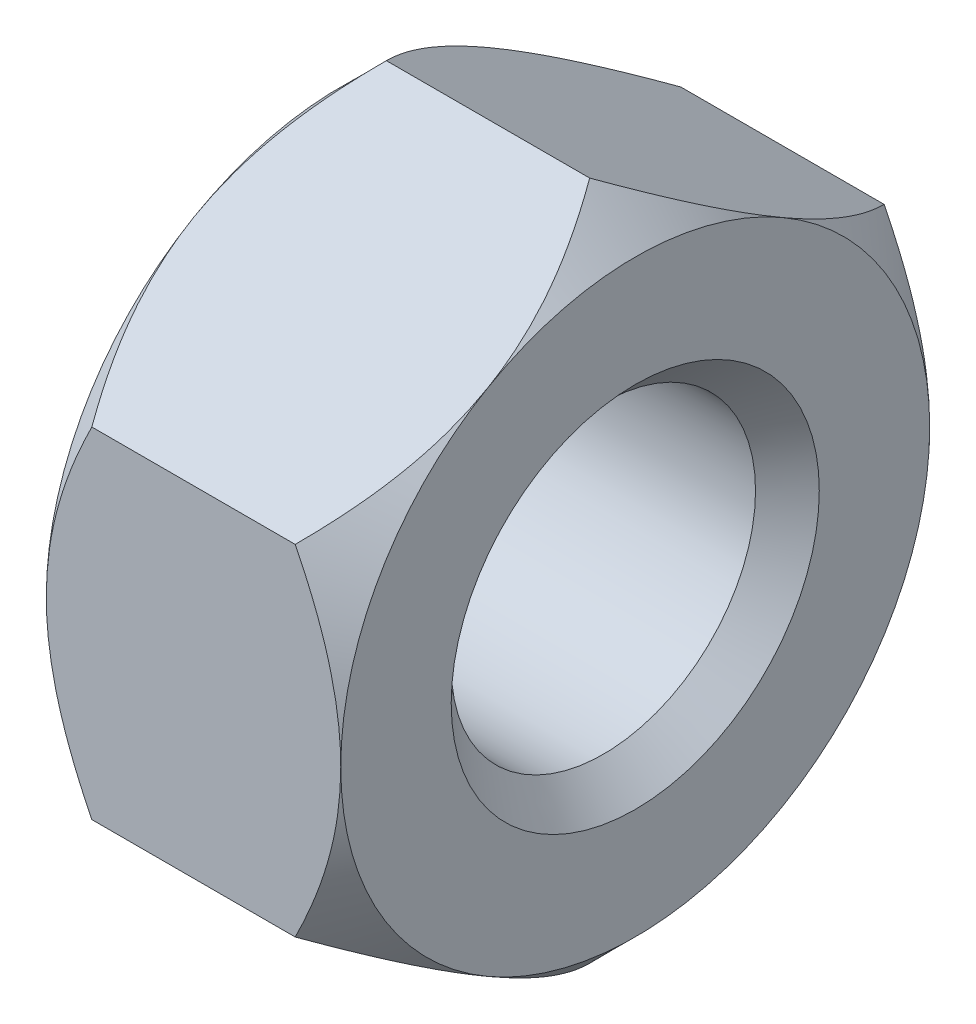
ISO-10303-21;
HEADER;
FILE_DESCRIPTION(('STEP AP214'),'2;1');
FILE_NAME('part.step','',(''),(''),'','','');
FILE_SCHEMA(('AUTOMOTIVE_DESIGN { 1 0 10303 214 1 1 1 1 }'));
ENDSEC;
DATA;
#1=APPLICATION_CONTEXT('core data for automotive mechanical design processes');
#2=APPLICATION_PROTOCOL_DEFINITION('international standard','automotive_design',2000,#1);
#3=PRODUCT_CONTEXT('',#1,'mechanical');
#4=PRODUCT('Part','Part','',(#3));
#5=PRODUCT_RELATED_PRODUCT_CATEGORY('part','',(#4));
#6=PRODUCT_DEFINITION_FORMATION('','',#4);
#7=PRODUCT_DEFINITION_CONTEXT('part definition',#1,'design');
#8=PRODUCT_DEFINITION('design','',#6,#7);
#9=PRODUCT_DEFINITION_SHAPE('','',#8);
#10=(LENGTH_UNIT() NAMED_UNIT(*) SI_UNIT(.MILLI.,.METRE.));
#11=(NAMED_UNIT(*) PLANE_ANGLE_UNIT() SI_UNIT($,.RADIAN.));
#12=(NAMED_UNIT(*) SI_UNIT($,.STERADIAN.) SOLID_ANGLE_UNIT());
#13=UNCERTAINTY_MEASURE_WITH_UNIT(LENGTH_MEASURE(1.E-05),#10,'distance_accuracy_value','');
#14=(GEOMETRIC_REPRESENTATION_CONTEXT(3) GLOBAL_UNCERTAINTY_ASSIGNED_CONTEXT((#13)) GLOBAL_UNIT_ASSIGNED_CONTEXT((#10,
#11,#12)) REPRESENTATION_CONTEXT('',''));
#15=CARTESIAN_POINT('',(0.,0.,0.));
#16=DIRECTION('',(0.,0.,1.));
#17=DIRECTION('',(1.,0.,0.));
#18=AXIS2_PLACEMENT_3D('',#15,#16,#17);
#19=CARTESIAN_POINT('',(4.,4.,0.));
#20=DIRECTION('',(-1.,0.,0.));
#21=DIRECTION('',(0.,0.,1.));
#22=AXIS2_PLACEMENT_3D('',#19,#20,#21);
#23=PLANE('',#22);
#24=CARTESIAN_POINT('',(4.0000000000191,0.,0.));
#25=DIRECTION('',(1.,0.,0.));
#26=DIRECTION('',(0.,0.,-1.));
#27=AXIS2_PLACEMENT_3D('',#24,#25,#26);
#28=CIRCLE('',#27,2.49999999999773);
#29=CARTESIAN_POINT('',(4.0000000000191,0.,-2.49999999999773));
#30=VERTEX_POINT('',#29);
#31=EDGE_CURVE('E273',#30,#30,#28,.F.);
#32=ORIENTED_EDGE('',*,*,#31,.T.);
#33=EDGE_LOOP('',(#32));
#34=FACE_BOUND('',#33,.T.);
#35=CARTESIAN_POINT('',(4.0000000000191,0.,0.));
#36=DIRECTION('',(-1.,0.,0.));
#37=DIRECTION('',(0.,0.,1.));
#38=AXIS2_PLACEMENT_3D('',#35,#36,#37);
#39=CIRCLE('',#38,4.0000000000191);
#40=CARTESIAN_POINT('',(4.00000000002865,-3.46410161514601,2.0000000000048));
#41=VERTEX_POINT('',#40);
#42=CARTESIAN_POINT('',(4.00000000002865,0.,4.00000000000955));
#43=VERTEX_POINT('',#42);
#44=EDGE_CURVE('E117',#41,#43,#39,.T.);
#45=ORIENTED_EDGE('',*,*,#44,.F.);
#46=CARTESIAN_POINT('',(4.0000000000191,0.,0.));
#47=DIRECTION('',(-1.,0.,0.));
#48=DIRECTION('',(0.,0.,1.));
#49=AXIS2_PLACEMENT_3D('',#46,#47,#48);
#50=CIRCLE('',#49,4.0000000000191);
#51=CARTESIAN_POINT('',(4.00000000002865,-3.46410161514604,-2.00000000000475));
#52=VERTEX_POINT('',#51);
#53=EDGE_CURVE('E20',#52,#41,#50,.T.);
#54=ORIENTED_EDGE('',*,*,#53,.F.);
#55=CARTESIAN_POINT('',(4.0000000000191,0.,0.));
#56=DIRECTION('',(-1.,0.,0.));
#57=DIRECTION('',(0.,0.,1.));
#58=AXIS2_PLACEMENT_3D('',#55,#56,#57);
#59=CIRCLE('',#58,4.0000000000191);
#60=CARTESIAN_POINT('',(4.00000000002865,0.,-4.00000000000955));
#61=VERTEX_POINT('',#60);
#62=EDGE_CURVE('E103',#61,#52,#59,.T.);
#63=ORIENTED_EDGE('',*,*,#62,.F.);
#64=CARTESIAN_POINT('',(4.0000000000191,0.,0.));
#65=DIRECTION('',(-1.,0.,0.));
#66=DIRECTION('',(0.,0.,1.));
#67=AXIS2_PLACEMENT_3D('',#64,#65,#66);
#68=CIRCLE('',#67,4.0000000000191);
#69=CARTESIAN_POINT('',(4.00000000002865,3.46410161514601,-2.0000000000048));
#70=VERTEX_POINT('',#69);
#71=EDGE_CURVE('E113',#70,#61,#68,.T.);
#72=ORIENTED_EDGE('',*,*,#71,.F.);
#73=CARTESIAN_POINT('',(4.0000000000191,0.,0.));
#74=DIRECTION('',(-1.,0.,0.));
#75=DIRECTION('',(0.,0.,1.));
#76=AXIS2_PLACEMENT_3D('',#73,#74,#75);
#77=CIRCLE('',#76,4.0000000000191);
#78=CARTESIAN_POINT('',(4.00000000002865,3.46410161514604,2.00000000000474));
#79=VERTEX_POINT('',#78);
#80=EDGE_CURVE('E414',#79,#70,#77,.T.);
#81=ORIENTED_EDGE('',*,*,#80,.F.);
#82=CARTESIAN_POINT('',(4.0000000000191,0.,0.));
#83=DIRECTION('',(-1.,0.,0.));
#84=DIRECTION('',(0.,0.,1.));
#85=AXIS2_PLACEMENT_3D('',#82,#83,#84);
#86=CIRCLE('',#85,4.0000000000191);
#87=EDGE_CURVE('E436',#43,#79,#86,.T.);
#88=ORIENTED_EDGE('',*,*,#87,.F.);
#89=EDGE_LOOP('',(#45,#54,#63,#72,#81,#88));
#90=FACE_BOUND('',#89,.T.);
#91=ADVANCED_FACE('F17',(#34,#90),#23,.F.);
#92=CARTESIAN_POINT('',(3.37748503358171,0.,0.));
#93=DIRECTION('',(-1.,0.,0.));
#94=DIRECTION('',(0.,0.,1.));
#95=AXIS2_PLACEMENT_3D('',#92,#93,#94);
#96=CONICAL_SURFACE('',#95,4.62251496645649,0.785398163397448);
#97=CARTESIAN_POINT('',(4.00000000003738,-3.46410161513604,1.99999999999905));
#98=CARTESIAN_POINT('',(4.0000049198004,-3.49481946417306,1.94679512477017));
#99=CARTESIAN_POINT('',(3.99858391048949,-3.52553272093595,1.89359820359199));
#100=CARTESIAN_POINT('',(3.99293637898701,-3.58688999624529,1.78732428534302));
#101=CARTESIAN_POINT('',(3.98871029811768,-3.61753402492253,1.73424727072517));
#102=CARTESIAN_POINT('',(3.97191541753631,-3.7091658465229,1.57553630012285));
#103=CARTESIAN_POINT('',(3.95522961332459,-3.76997519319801,1.47021142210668));
#104=CARTESIAN_POINT('',(3.9120897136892,-3.88974997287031,1.26275541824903));
#105=CARTESIAN_POINT('',(3.88578673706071,-3.9487293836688,1.16060008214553));
#106=CARTESIAN_POINT('',(3.8245563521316,-4.06556911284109,0.958227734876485));
#107=CARTESIAN_POINT('',(3.78962624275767,-4.12342907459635,0.858011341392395));
#108=CARTESIAN_POINT('',(3.72579547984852,-4.21805562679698,0.694113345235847));
#109=CARTESIAN_POINT('',(3.69899953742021,-4.25518413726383,0.629804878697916));
#110=CARTESIAN_POINT('',(3.64260965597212,-4.32889736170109,0.502129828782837));
#111=CARTESIAN_POINT('',(3.61301630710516,-4.3654821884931,0.438763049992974));
#112=CARTESIAN_POINT('',(3.5510262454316,-4.43849718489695,0.312297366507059));
#113=CARTESIAN_POINT('',(3.51860370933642,-4.47492184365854,0.249208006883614));
#114=CARTESIAN_POINT('',(3.45151314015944,-4.54724829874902,0.123934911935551));
#115=CARTESIAN_POINT('',(3.41684525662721,-4.58315012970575,0.0617511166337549));
#116=CARTESIAN_POINT('',(3.38119784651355,-4.61880215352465,-1.32323642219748E-11));
#117=B_SPLINE_CURVE_WITH_KNOTS('',3,(#97,#98,#99,#100,#101,#102,#103,#104,#105,#106,#107,#108,
#109,#110,#111,#112,#113,#114,#115,#116),.UNSPECIFIED.,.F.,.F.,(4,2,2,2,2,2,2,2,2,4),(0.,
0.184273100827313,0.368517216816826,0.736277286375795,1.09849087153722,1.46081800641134,
1.69759619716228,1.93432454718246,2.17350072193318,2.41266098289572),.UNSPECIFIED.);
#118=CARTESIAN_POINT('',(3.38119784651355,-4.61880215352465,0.));
#119=VERTEX_POINT('',#118);
#120=EDGE_CURVE('E131',#41,#119,#117,.T.);
#121=ORIENTED_EDGE('',*,*,#120,.T.);
#122=CARTESIAN_POINT('',(3.38119784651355,-4.61880215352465,1.32315827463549E-11));
#123=CARTESIAN_POINT('',(3.42115298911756,-4.57884085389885,-0.0692150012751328));
#124=CARTESIAN_POINT('',(3.45987412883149,-4.53857054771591,-0.138965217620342));
#125=CARTESIAN_POINT('',(3.53447131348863,-4.4573496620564,-0.279643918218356));
#126=CARTESIAN_POINT('',(3.57034570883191,-4.41639870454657,-0.350573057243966));
#127=CARTESIAN_POINT('',(3.67347057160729,-4.29201201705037,-0.566017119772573));
#128=CARTESIAN_POINT('',(3.73573980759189,-4.2075147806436,-0.712370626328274));
#129=CARTESIAN_POINT('',(3.84145050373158,-4.03823843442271,-1.00556585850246));
#130=CARTESIAN_POINT('',(3.88538656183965,-3.95353888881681,-1.15226977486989));
#131=CARTESIAN_POINT('',(3.93621631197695,-3.82513617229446,-1.37466980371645));
#132=CARTESIAN_POINT('',(3.95063867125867,-3.78216330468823,-1.44910099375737));
#133=CARTESIAN_POINT('',(3.97413995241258,-3.69585814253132,-1.59858591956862));
#134=CARTESIAN_POINT('',(3.98322052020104,-3.65252596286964,-1.67363945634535));
#135=CARTESIAN_POINT('',(3.99298432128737,-3.58502030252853,-1.79056268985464));
#136=CARTESIAN_POINT('',(3.995606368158,-3.56091327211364,-1.83231729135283));
#137=CARTESIAN_POINT('',(3.99911864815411,-3.51257212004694,-1.91604662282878));
#138=CARTESIAN_POINT('',(4.00000198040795,-3.48833787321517,-1.95802156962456));
#139=CARTESIAN_POINT('',(4.0000000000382,-3.4641016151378,-1.99999999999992));
#140=B_SPLINE_CURVE_WITH_KNOTS('',3,(#122,#123,#124,#125,#126,#127,#128,#129,#130,#131,#132,
#133,#134,#135,#136,#137,#138,#139),.UNSPECIFIED.,.F.,.F.,(4,2,2,2,2,2,2,2,4),(0.,
0.268044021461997,0.536242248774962,1.07581329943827,1.59970270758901,1.86100635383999,
2.1222294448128,2.26705747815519,2.41245917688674),.UNSPECIFIED.);
#141=EDGE_CURVE('E125',#119,#52,#140,.T.);
#142=ORIENTED_EDGE('',*,*,#141,.T.);
#143=ORIENTED_EDGE('',*,*,#53,.T.);
#144=EDGE_LOOP('',(#121,#142,#143));
#145=FACE_BOUND('',#144,.T.);
#146=ADVANCED_FACE('F130',(#145),#96,.T.);
#147=CARTESIAN_POINT('',(3.37748503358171,0.,0.));
#148=DIRECTION('',(-1.,0.,0.));
#149=DIRECTION('',(0.,0.,1.));
#150=AXIS2_PLACEMENT_3D('',#147,#148,#149);
#151=CONICAL_SURFACE('',#150,4.62251496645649,0.785398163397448);
#152=CARTESIAN_POINT('',(4.00000000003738,-3.46410161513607,-1.99999999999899));
#153=CARTESIAN_POINT('',(4.0000049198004,-3.43338376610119,-2.05320487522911));
#154=CARTESIAN_POINT('',(3.99858391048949,-3.40267050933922,-2.10640179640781));
#155=CARTESIAN_POINT('',(3.99293637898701,-3.34131323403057,-2.21267571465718));
#156=CARTESIAN_POINT('',(3.98871029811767,-3.3106692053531,-2.26575272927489));
#157=CARTESIAN_POINT('',(3.97191541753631,-3.21903738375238,-2.42446369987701));
#158=CARTESIAN_POINT('',(3.95522961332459,-3.15822803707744,-2.52978857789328));
#159=CARTESIAN_POINT('',(3.9120897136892,-3.03845325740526,-2.737244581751));
#160=CARTESIAN_POINT('',(3.88578673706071,-2.97947384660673,-2.83939991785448));
#161=CARTESIAN_POINT('',(3.8245563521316,-2.8626341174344,-3.0417722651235));
#162=CARTESIAN_POINT('',(3.78962624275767,-2.80477415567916,-3.1419886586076));
#163=CARTESIAN_POINT('',(3.72579547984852,-2.71014760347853,-3.30588665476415));
#164=CARTESIAN_POINT('',(3.69899953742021,-2.67301909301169,-3.37019512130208));
#165=CARTESIAN_POINT('',(3.64260965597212,-2.59930586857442,-3.49787017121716));
#166=CARTESIAN_POINT('',(3.61301630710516,-2.56272104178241,-3.56123695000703));
#167=CARTESIAN_POINT('',(3.5510262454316,-2.48970604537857,-3.68770263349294));
#168=CARTESIAN_POINT('',(3.51860370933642,-2.45328138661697,-3.75079199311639));
#169=CARTESIAN_POINT('',(3.45151314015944,-2.38095493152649,-3.87606508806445));
#170=CARTESIAN_POINT('',(3.41684525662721,-2.34505310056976,-3.93824888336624));
#171=CARTESIAN_POINT('',(3.38119784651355,-2.30940107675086,-4.00000000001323));
#172=B_SPLINE_CURVE_WITH_KNOTS('',3,(#152,#153,#154,#155,#156,#157,#158,#159,#160,#161,#162,
#163,#164,#165,#166,#167,#168,#169,#170,#171),.UNSPECIFIED.,.F.,.F.,(4,2,2,2,2,2,2,2,2,4),(0.,
0.184273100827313,0.368517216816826,0.736277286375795,1.09849087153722,1.46081800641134,
1.69759619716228,1.93432454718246,2.17350072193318,2.41266098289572),.UNSPECIFIED.);
#173=CARTESIAN_POINT('',(3.38119784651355,-2.30940107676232,-4.00000000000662));
#174=VERTEX_POINT('',#173);
#175=EDGE_CURVE('E107',#52,#174,#172,.T.);
#176=ORIENTED_EDGE('',*,*,#175,.T.);
#177=CARTESIAN_POINT('',(3.38119784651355,-2.30940107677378,-4.));
#178=CARTESIAN_POINT('',(3.42115298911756,-2.22947847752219,-4.));
#179=CARTESIAN_POINT('',(3.45987412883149,-2.14893786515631,-4.));
#180=CARTESIAN_POINT('',(3.53447131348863,-1.98649609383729,-4.));
#181=CARTESIAN_POINT('',(3.57034570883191,-1.90459417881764,-4.));
#182=CARTESIAN_POINT('',(3.67347057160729,-1.65582080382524,-4.));
#183=CARTESIAN_POINT('',(3.73573980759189,-1.48682633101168,-4.));
#184=CARTESIAN_POINT('',(3.84145050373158,-1.14827363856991,-4.));
#185=CARTESIAN_POINT('',(3.88538656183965,-0.978874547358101,-4.));
#186=CARTESIAN_POINT('',(3.93621631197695,-0.722069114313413,-4.));
#187=CARTESIAN_POINT('',(3.95063867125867,-0.636123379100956,-4.));
#188=CARTESIAN_POINT('',(3.97413995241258,-0.46351305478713,-4.));
#189=CARTESIAN_POINT('',(3.98322052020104,-0.376848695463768,-4.));
#190=CARTESIAN_POINT('',(3.99298432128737,-0.241837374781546,-4.));
#191=CARTESIAN_POINT('',(3.995606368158,-0.193623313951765,-4.));
#192=CARTESIAN_POINT('',(3.99911864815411,-0.096941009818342,-4.));
#193=CARTESIAN_POINT('',(4.00000198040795,-0.0484725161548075,-4.));
#194=CARTESIAN_POINT('',(4.0000000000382,0.,-4.));
#195=B_SPLINE_CURVE_WITH_KNOTS('',3,(#177,#178,#179,#180,#181,#182,#183,#184,#185,#186,#187,
#188,#189,#190,#191,#192,#193,#194),.UNSPECIFIED.,.F.,.F.,(4,2,2,2,2,2,2,2,4),(0.,
0.268044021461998,0.536242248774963,1.07581329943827,1.59970270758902,1.86100635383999,
2.1222294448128,2.26705747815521,2.41245917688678),.UNSPECIFIED.);
#196=EDGE_CURVE('E109',#174,#61,#195,.T.);
#197=ORIENTED_EDGE('',*,*,#196,.T.);
#198=ORIENTED_EDGE('',*,*,#62,.T.);
#199=EDGE_LOOP('',(#176,#197,#198));
#200=FACE_BOUND('',#199,.T.);
#201=ADVANCED_FACE('F105',(#200),#151,.T.);
#202=CARTESIAN_POINT('',(3.37748503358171,0.,0.));
#203=DIRECTION('',(-1.,0.,0.));
#204=DIRECTION('',(0.,0.,1.));
#205=AXIS2_PLACEMENT_3D('',#202,#203,#204);
#206=CONICAL_SURFACE('',#205,4.62251496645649,0.785398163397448);
#207=CARTESIAN_POINT('',(4.00000000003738,0.,-3.99999999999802));
#208=CARTESIAN_POINT('',(4.0000049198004,0.0614356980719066,-3.99999999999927));
#209=CARTESIAN_POINT('',(3.99858391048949,0.122862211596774,-3.9999999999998));
#210=CARTESIAN_POINT('',(3.99293637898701,0.245576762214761,-4.0000000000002));
#211=CARTESIAN_POINT('',(3.98871029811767,0.306864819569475,-4.00000000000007));
#212=CARTESIAN_POINT('',(3.97191541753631,0.490128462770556,-3.99999999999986));
#213=CARTESIAN_POINT('',(3.95522961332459,0.61174715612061,-3.99999999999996));
#214=CARTESIAN_POINT('',(3.9120897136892,0.851296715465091,-4.00000000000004));
#215=CARTESIAN_POINT('',(3.8857867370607,0.969255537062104,-4.00000000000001));
#216=CARTESIAN_POINT('',(3.82455635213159,1.20293499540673,-3.99999999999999));
#217=CARTESIAN_POINT('',(3.78962624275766,1.31865491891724,-4.));
#218=CARTESIAN_POINT('',(3.72579547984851,1.50790802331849,-4.));
#219=CARTESIAN_POINT('',(3.6989995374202,1.58216504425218,-4.));
#220=CARTESIAN_POINT('',(3.64260965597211,1.72959149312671,-4.));
#221=CARTESIAN_POINT('',(3.61301630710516,1.80276114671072,-4.));
#222=CARTESIAN_POINT('',(3.55102624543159,1.9487911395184,-4.));
#223=CARTESIAN_POINT('',(3.51860370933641,2.02164045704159,-4.));
#224=CARTESIAN_POINT('',(3.45151314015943,2.16629336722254,-4.));
#225=CARTESIAN_POINT('',(3.41684525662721,2.23809702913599,-4.));
#226=CARTESIAN_POINT('',(3.38119784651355,2.30940107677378,-4.));
#227=B_SPLINE_CURVE_WITH_KNOTS('',3,(#207,#208,#209,#210,#211,#212,#213,#214,#215,#216,#217,
#218,#219,#220,#221,#222,#223,#224,#225,#226),.UNSPECIFIED.,.F.,.F.,(4,2,2,2,2,2,2,2,2,4),(0.,
0.184273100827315,0.368517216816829,0.7362772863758,1.09849087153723,1.46081800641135,
1.69759619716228,1.93432454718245,2.17350072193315,2.41266098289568),.UNSPECIFIED.);
#228=CARTESIAN_POINT('',(3.38119784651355,2.30940107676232,-4.00000000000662));
#229=VERTEX_POINT('',#228);
#230=EDGE_CURVE('E166',#61,#229,#227,.T.);
#231=ORIENTED_EDGE('',*,*,#230,.T.);
#232=CARTESIAN_POINT('',(3.38119784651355,2.30940107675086,-4.00000000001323));
#233=CARTESIAN_POINT('',(3.42115298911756,2.34936237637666,-3.93078499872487));
#234=CARTESIAN_POINT('',(3.45987412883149,2.3896326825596,-3.86103478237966));
#235=CARTESIAN_POINT('',(3.53447131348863,2.47085356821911,-3.72035608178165));
#236=CARTESIAN_POINT('',(3.57034570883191,2.51180452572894,-3.64942694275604));
#237=CARTESIAN_POINT('',(3.67347057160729,2.63619121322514,-3.43398288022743));
#238=CARTESIAN_POINT('',(3.73573980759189,2.72068844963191,-3.28762937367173));
#239=CARTESIAN_POINT('',(3.84145050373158,2.8899647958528,-2.99443414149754));
#240=CARTESIAN_POINT('',(3.88538656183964,2.9746643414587,-2.84773022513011));
#241=CARTESIAN_POINT('',(3.93621631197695,3.10306705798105,-2.62533019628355));
#242=CARTESIAN_POINT('',(3.95063867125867,3.14603992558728,-2.55089900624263));
#243=CARTESIAN_POINT('',(3.97413995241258,3.23234508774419,-2.40141408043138));
#244=CARTESIAN_POINT('',(3.98322052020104,3.27567726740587,-2.32636054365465));
#245=CARTESIAN_POINT('',(3.99298432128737,3.34318292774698,-2.20943731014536));
#246=CARTESIAN_POINT('',(3.995606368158,3.36728995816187,-2.16768270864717));
#247=CARTESIAN_POINT('',(3.99911864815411,3.41563111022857,-2.08395337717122));
#248=CARTESIAN_POINT('',(4.00000198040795,3.43986535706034,-2.04197843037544));
#249=CARTESIAN_POINT('',(4.0000000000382,3.46410161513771,-2.00000000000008));
#250=B_SPLINE_CURVE_WITH_KNOTS('',3,(#232,#233,#234,#235,#236,#237,#238,#239,#240,#241,#242,
#243,#244,#245,#246,#247,#248,#249),.UNSPECIFIED.,.F.,.F.,(4,2,2,2,2,2,2,2,4),(0.,
0.268044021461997,0.536242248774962,1.07581329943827,1.59970270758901,1.86100635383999,
2.1222294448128,2.26705747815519,2.41245917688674),.UNSPECIFIED.);
#251=EDGE_CURVE('E378',#229,#70,#250,.T.);
#252=ORIENTED_EDGE('',*,*,#251,.T.);
#253=ORIENTED_EDGE('',*,*,#71,.T.);
#254=EDGE_LOOP('',(#231,#252,#253));
#255=FACE_BOUND('',#254,.T.);
#256=ADVANCED_FACE('F158',(#255),#206,.T.);
#257=CARTESIAN_POINT('',(3.37748503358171,0.,0.));
#258=DIRECTION('',(-1.,0.,0.));
#259=DIRECTION('',(0.,0.,1.));
#260=AXIS2_PLACEMENT_3D('',#257,#258,#259);
#261=CONICAL_SURFACE('',#260,4.62251496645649,0.785398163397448);
#262=CARTESIAN_POINT('',(4.00000000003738,0.,3.99999999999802));
#263=CARTESIAN_POINT('',(4.0000049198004,-0.0614356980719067,3.99999999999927));
#264=CARTESIAN_POINT('',(3.99858391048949,-0.122862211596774,3.9999999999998));
#265=CARTESIAN_POINT('',(3.99293637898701,-0.245576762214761,4.0000000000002));
#266=CARTESIAN_POINT('',(3.98871029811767,-0.306864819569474,4.00000000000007));
#267=CARTESIAN_POINT('',(3.97191541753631,-0.490128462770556,3.99999999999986));
#268=CARTESIAN_POINT('',(3.95522961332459,-0.61174715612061,3.99999999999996));
#269=CARTESIAN_POINT('',(3.9120897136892,-0.851296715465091,4.00000000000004));
#270=CARTESIAN_POINT('',(3.8857867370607,-0.969255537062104,4.00000000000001));
#271=CARTESIAN_POINT('',(3.82455635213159,-1.20293499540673,3.99999999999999));
#272=CARTESIAN_POINT('',(3.78962624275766,-1.31865491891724,4.));
#273=CARTESIAN_POINT('',(3.72579547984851,-1.50790802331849,4.));
#274=CARTESIAN_POINT('',(3.6989995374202,-1.58216504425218,4.));
#275=CARTESIAN_POINT('',(3.64260965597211,-1.72959149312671,4.));
#276=CARTESIAN_POINT('',(3.61301630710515,-1.80276114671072,4.));
#277=CARTESIAN_POINT('',(3.55102624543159,-1.9487911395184,4.));
#278=CARTESIAN_POINT('',(3.51860370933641,-2.02164045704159,4.));
#279=CARTESIAN_POINT('',(3.45151314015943,-2.16629336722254,4.));
#280=CARTESIAN_POINT('',(3.41684525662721,-2.23809702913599,4.));
#281=CARTESIAN_POINT('',(3.38119784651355,-2.30940107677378,4.));
#282=B_SPLINE_CURVE_WITH_KNOTS('',3,(#262,#263,#264,#265,#266,#267,#268,#269,#270,#271,#272,
#273,#274,#275,#276,#277,#278,#279,#280,#281),.UNSPECIFIED.,.F.,.F.,(4,2,2,2,2,2,2,2,2,4),(0.,
0.184273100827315,0.368517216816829,0.7362772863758,1.09849087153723,1.46081800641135,
1.69759619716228,1.93432454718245,2.17350072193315,2.41266098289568),.UNSPECIFIED.);
#283=CARTESIAN_POINT('',(3.38119784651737,-2.30940107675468,4.00000000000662));
#284=VERTEX_POINT('',#283);
#285=EDGE_CURVE('E284',#43,#284,#282,.T.);
#286=ORIENTED_EDGE('',*,*,#285,.T.);
#287=CARTESIAN_POINT('',(3.38119784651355,-2.30940107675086,4.00000000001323));
#288=CARTESIAN_POINT('',(3.42115298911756,-2.34936237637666,3.93078499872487));
#289=CARTESIAN_POINT('',(3.45987412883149,-2.3896326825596,3.86103478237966));
#290=CARTESIAN_POINT('',(3.53447131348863,-2.47085356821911,3.72035608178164));
#291=CARTESIAN_POINT('',(3.57034570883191,-2.51180452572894,3.64942694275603));
#292=CARTESIAN_POINT('',(3.67347057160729,-2.63619121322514,3.43398288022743));
#293=CARTESIAN_POINT('',(3.73573980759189,-2.72068844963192,3.28762937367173));
#294=CARTESIAN_POINT('',(3.84145050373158,-2.8899647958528,2.99443414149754));
#295=CARTESIAN_POINT('',(3.88538656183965,-2.97466434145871,2.84773022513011));
#296=CARTESIAN_POINT('',(3.93621631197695,-3.10306705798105,2.62533019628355));
#297=CARTESIAN_POINT('',(3.95063867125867,-3.14603992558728,2.55089900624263));
#298=CARTESIAN_POINT('',(3.97413995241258,-3.23234508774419,2.40141408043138));
#299=CARTESIAN_POINT('',(3.98322052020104,-3.27567726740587,2.32636054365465));
#300=CARTESIAN_POINT('',(3.99298432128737,-3.34318292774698,2.20943731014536));
#301=CARTESIAN_POINT('',(3.995606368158,-3.36728995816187,2.16768270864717));
#302=CARTESIAN_POINT('',(3.99911864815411,-3.41563111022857,2.08395337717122));
#303=CARTESIAN_POINT('',(4.00000198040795,-3.43986535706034,2.04197843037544));
#304=CARTESIAN_POINT('',(4.0000000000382,-3.46410161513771,2.00000000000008));
#305=B_SPLINE_CURVE_WITH_KNOTS('',3,(#287,#288,#289,#290,#291,#292,#293,#294,#295,#296,#297,
#298,#299,#300,#301,#302,#303,#304),.UNSPECIFIED.,.F.,.F.,(4,2,2,2,2,2,2,2,4),(0.,
0.268044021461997,0.536242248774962,1.07581329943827,1.59970270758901,1.86100635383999,
2.1222294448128,2.26705747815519,2.41245917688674),.UNSPECIFIED.);
#306=EDGE_CURVE('E267',#284,#41,#305,.T.);
#307=ORIENTED_EDGE('',*,*,#306,.T.);
#308=ORIENTED_EDGE('',*,*,#44,.T.);
#309=EDGE_LOOP('',(#286,#307,#308));
#310=FACE_BOUND('',#309,.T.);
#311=ADVANCED_FACE('F275',(#310),#261,.T.);
#312=CARTESIAN_POINT('',(3.37748503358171,0.,0.));
#313=DIRECTION('',(-1.,0.,0.));
#314=DIRECTION('',(0.,0.,1.));
#315=AXIS2_PLACEMENT_3D('',#312,#313,#314);
#316=CONICAL_SURFACE('',#315,4.62251496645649,0.785398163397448);
#317=CARTESIAN_POINT('',(3.38119784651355,4.61880215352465,-1.32317138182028E-11));
#318=CARTESIAN_POINT('',(3.42115298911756,4.57884085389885,0.0692150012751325));
#319=CARTESIAN_POINT('',(3.45987412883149,4.53857054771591,0.138965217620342));
#320=CARTESIAN_POINT('',(3.53447131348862,4.4573496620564,0.279643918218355));
#321=CARTESIAN_POINT('',(3.57034570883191,4.41639870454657,0.350573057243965));
#322=CARTESIAN_POINT('',(3.67347057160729,4.29201201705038,0.566017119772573));
#323=CARTESIAN_POINT('',(3.73573980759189,4.2075147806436,0.712370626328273));
#324=CARTESIAN_POINT('',(3.84145050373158,4.03823843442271,1.00556585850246));
#325=CARTESIAN_POINT('',(3.88538656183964,3.95353888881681,1.15226977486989));
#326=CARTESIAN_POINT('',(3.93621631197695,3.82513617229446,1.37466980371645));
#327=CARTESIAN_POINT('',(3.95063867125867,3.78216330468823,1.44910099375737));
#328=CARTESIAN_POINT('',(3.97413995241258,3.69585814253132,1.59858591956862));
#329=CARTESIAN_POINT('',(3.98322052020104,3.65252596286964,1.67363945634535));
#330=CARTESIAN_POINT('',(3.99298432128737,3.58502030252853,1.79056268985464));
#331=CARTESIAN_POINT('',(3.995606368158,3.56091327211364,1.83231729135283));
#332=CARTESIAN_POINT('',(3.99911864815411,3.51257212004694,1.91604662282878));
#333=CARTESIAN_POINT('',(4.00000198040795,3.48833787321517,1.95802156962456));
#334=CARTESIAN_POINT('',(4.0000000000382,3.4641016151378,1.99999999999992));
#335=B_SPLINE_CURVE_WITH_KNOTS('',3,(#317,#318,#319,#320,#321,#322,#323,#324,#325,#326,#327,
#328,#329,#330,#331,#332,#333,#334),.UNSPECIFIED.,.F.,.F.,(4,2,2,2,2,2,2,2,4),(0.,
0.268044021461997,0.536242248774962,1.07581329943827,1.59970270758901,1.86100635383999,
2.1222294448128,2.26705747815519,2.41245917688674),.UNSPECIFIED.);
#336=CARTESIAN_POINT('',(3.38119784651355,4.61880215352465,0.));
#337=VERTEX_POINT('',#336);
#338=EDGE_CURVE('E293',#337,#79,#335,.T.);
#339=ORIENTED_EDGE('',*,*,#338,.T.);
#340=ORIENTED_EDGE('',*,*,#80,.T.);
#341=CARTESIAN_POINT('',(4.00000000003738,3.46410161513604,-1.99999999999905));
#342=CARTESIAN_POINT('',(4.0000049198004,3.49481946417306,-1.94679512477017));
#343=CARTESIAN_POINT('',(3.99858391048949,3.52553272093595,-1.89359820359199));
#344=CARTESIAN_POINT('',(3.99293637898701,3.58688999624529,-1.78732428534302));
#345=CARTESIAN_POINT('',(3.98871029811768,3.61753402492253,-1.73424727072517));
#346=CARTESIAN_POINT('',(3.97191541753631,3.70916584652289,-1.57553630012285));
#347=CARTESIAN_POINT('',(3.95522961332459,3.76997519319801,-1.47021142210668));
#348=CARTESIAN_POINT('',(3.9120897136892,3.88974997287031,-1.26275541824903));
#349=CARTESIAN_POINT('',(3.88578673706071,3.94872938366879,-1.16060008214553));
#350=CARTESIAN_POINT('',(3.8245563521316,4.06556911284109,-0.958227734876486));
#351=CARTESIAN_POINT('',(3.78962624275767,4.12342907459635,-0.858011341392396));
#352=CARTESIAN_POINT('',(3.72579547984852,4.21805562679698,-0.694113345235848));
#353=CARTESIAN_POINT('',(3.69899953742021,4.25518413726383,-0.629804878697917));
#354=CARTESIAN_POINT('',(3.64260965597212,4.32889736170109,-0.502129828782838));
#355=CARTESIAN_POINT('',(3.61301630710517,4.3654821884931,-0.438763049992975));
#356=CARTESIAN_POINT('',(3.5510262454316,4.43849718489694,-0.312297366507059));
#357=CARTESIAN_POINT('',(3.51860370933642,4.47492184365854,-0.249208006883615));
#358=CARTESIAN_POINT('',(3.45151314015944,4.54724829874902,-0.123934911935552));
#359=CARTESIAN_POINT('',(3.41684525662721,4.58315012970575,-0.0617511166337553));
#360=CARTESIAN_POINT('',(3.38119784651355,4.61880215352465,1.32321734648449E-11));
#361=B_SPLINE_CURVE_WITH_KNOTS('',3,(#341,#342,#343,#344,#345,#346,#347,#348,#349,#350,#351,
#352,#353,#354,#355,#356,#357,#358,#359,#360),.UNSPECIFIED.,.F.,.F.,(4,2,2,2,2,2,2,2,2,4),(0.,
0.184273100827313,0.368517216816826,0.736277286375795,1.09849087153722,1.46081800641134,
1.69759619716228,1.93432454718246,2.17350072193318,2.41266098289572),.UNSPECIFIED.);
#362=EDGE_CURVE('E416',#70,#337,#361,.T.);
#363=ORIENTED_EDGE('',*,*,#362,.T.);
#364=EDGE_LOOP('',(#339,#340,#363));
#365=FACE_BOUND('',#364,.T.);
#366=ADVANCED_FACE('F279',(#365),#316,.T.);
#367=CARTESIAN_POINT('',(3.37748503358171,0.,0.));
#368=DIRECTION('',(-1.,0.,0.));
#369=DIRECTION('',(0.,0.,1.));
#370=AXIS2_PLACEMENT_3D('',#367,#368,#369);
#371=CONICAL_SURFACE('',#370,4.62251496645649,0.785398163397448);
#372=CARTESIAN_POINT('',(4.00000000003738,3.46410161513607,1.99999999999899));
#373=CARTESIAN_POINT('',(4.0000049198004,3.43338376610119,2.05320487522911));
#374=CARTESIAN_POINT('',(3.99858391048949,3.40267050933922,2.10640179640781));
#375=CARTESIAN_POINT('',(3.99293637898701,3.34131323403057,2.21267571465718));
#376=CARTESIAN_POINT('',(3.98871029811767,3.3106692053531,2.26575272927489));
#377=CARTESIAN_POINT('',(3.97191541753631,3.21903738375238,2.42446369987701));
#378=CARTESIAN_POINT('',(3.95522961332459,3.15822803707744,2.52978857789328));
#379=CARTESIAN_POINT('',(3.9120897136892,3.03845325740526,2.737244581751));
#380=CARTESIAN_POINT('',(3.88578673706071,2.97947384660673,2.83939991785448));
#381=CARTESIAN_POINT('',(3.8245563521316,2.8626341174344,3.0417722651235));
#382=CARTESIAN_POINT('',(3.78962624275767,2.80477415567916,3.1419886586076));
#383=CARTESIAN_POINT('',(3.72579547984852,2.71014760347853,3.30588665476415));
#384=CARTESIAN_POINT('',(3.69899953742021,2.67301909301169,3.37019512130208));
#385=CARTESIAN_POINT('',(3.64260965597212,2.59930586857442,3.49787017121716));
#386=CARTESIAN_POINT('',(3.61301630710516,2.56272104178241,3.56123695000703));
#387=CARTESIAN_POINT('',(3.5510262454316,2.48970604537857,3.68770263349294));
#388=CARTESIAN_POINT('',(3.51860370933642,2.45328138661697,3.75079199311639));
#389=CARTESIAN_POINT('',(3.45151314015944,2.38095493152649,3.87606508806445));
#390=CARTESIAN_POINT('',(3.41684525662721,2.34505310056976,3.93824888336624));
#391=CARTESIAN_POINT('',(3.38119784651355,2.30940107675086,4.00000000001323));
#392=B_SPLINE_CURVE_WITH_KNOTS('',3,(#372,#373,#374,#375,#376,#377,#378,#379,#380,#381,#382,
#383,#384,#385,#386,#387,#388,#389,#390,#391),.UNSPECIFIED.,.F.,.F.,(4,2,2,2,2,2,2,2,2,4),(0.,
0.184273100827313,0.368517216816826,0.736277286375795,1.09849087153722,1.46081800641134,
1.69759619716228,1.93432454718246,2.17350072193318,2.41266098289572),.UNSPECIFIED.);
#393=CARTESIAN_POINT('',(3.38119784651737,2.30940107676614,4.));
#394=VERTEX_POINT('',#393);
#395=EDGE_CURVE('E386',#79,#394,#392,.T.);
#396=ORIENTED_EDGE('',*,*,#395,.T.);
#397=CARTESIAN_POINT('',(3.38119784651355,2.30940107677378,4.));
#398=CARTESIAN_POINT('',(3.42115298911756,2.22947847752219,4.));
#399=CARTESIAN_POINT('',(3.45987412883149,2.14893786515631,4.));
#400=CARTESIAN_POINT('',(3.53447131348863,1.98649609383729,4.));
#401=CARTESIAN_POINT('',(3.57034570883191,1.90459417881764,4.));
#402=CARTESIAN_POINT('',(3.67347057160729,1.65582080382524,4.));
#403=CARTESIAN_POINT('',(3.73573980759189,1.48682633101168,4.));
#404=CARTESIAN_POINT('',(3.84145050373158,1.14827363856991,4.));
#405=CARTESIAN_POINT('',(3.88538656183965,0.978874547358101,4.));
#406=CARTESIAN_POINT('',(3.93621631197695,0.722069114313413,4.));
#407=CARTESIAN_POINT('',(3.95063867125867,0.636123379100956,4.));
#408=CARTESIAN_POINT('',(3.97413995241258,0.463513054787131,4.));
#409=CARTESIAN_POINT('',(3.98322052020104,0.376848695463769,4.));
#410=CARTESIAN_POINT('',(3.99298432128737,0.241837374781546,4.));
#411=CARTESIAN_POINT('',(3.995606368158,0.193623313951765,4.));
#412=CARTESIAN_POINT('',(3.99911864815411,0.0969410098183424,4.));
#413=CARTESIAN_POINT('',(4.00000198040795,0.0484725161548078,4.));
#414=CARTESIAN_POINT('',(4.0000000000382,0.,4.));
#415=B_SPLINE_CURVE_WITH_KNOTS('',3,(#397,#398,#399,#400,#401,#402,#403,#404,#405,#406,#407,
#408,#409,#410,#411,#412,#413,#414),.UNSPECIFIED.,.F.,.F.,(4,2,2,2,2,2,2,2,4),(0.,
0.268044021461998,0.536242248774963,1.07581329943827,1.59970270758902,1.86100635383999,
2.1222294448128,2.26705747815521,2.41245917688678),.UNSPECIFIED.);
#416=EDGE_CURVE('E292',#394,#43,#415,.T.);
#417=ORIENTED_EDGE('',*,*,#416,.T.);
#418=ORIENTED_EDGE('',*,*,#87,.T.);
#419=EDGE_LOOP('',(#396,#417,#418));
#420=FACE_BOUND('',#419,.T.);
#421=ADVANCED_FACE('F400',(#420),#371,.T.);
#422=CARTESIAN_POINT('',(4.0000000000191,0.,0.));
#423=DIRECTION('',(1.,0.,0.));
#424=DIRECTION('',(0.,0.,-1.));
#425=AXIS2_PLACEMENT_3D('',#422,#423,#424);
#426=CONICAL_SURFACE('',#425,2.49999999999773,0.785398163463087);
#427=CARTESIAN_POINT('',(3.567,0.,0.));
#428=DIRECTION('',(-1.,0.,0.));
#429=DIRECTION('',(0.,0.,1.));
#430=AXIS2_PLACEMENT_3D('',#427,#428,#429);
#431=CIRCLE('',#430,2.067);
#432=CARTESIAN_POINT('',(3.567,0.,2.067));
#433=VERTEX_POINT('',#432);
#434=EDGE_CURVE('E370',#433,#433,#431,.T.);
#435=ORIENTED_EDGE('',*,*,#434,.T.);
#436=EDGE_LOOP('',(#435));
#437=FACE_BOUND('',#436,.T.);
#438=ORIENTED_EDGE('',*,*,#31,.F.);
#439=EDGE_LOOP('',(#438));
#440=FACE_BOUND('',#439,.T.);
#441=ADVANCED_FACE('F255',(#437,#440),#426,.F.);
#442=CARTESIAN_POINT('',(8.,-2.3094010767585,4.));
#443=DIRECTION('',(0.,0.866025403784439,-0.5));
#444=DIRECTION('',(0.,0.5,0.866025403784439));
#445=AXIS2_PLACEMENT_3D('',#442,#443,#444);
#446=PLANE('',#445);
#447=ORIENTED_EDGE('',*,*,#120,.F.);
#448=ORIENTED_EDGE('',*,*,#306,.F.);
#449=DIRECTION('',(-1.,0.,0.));
#450=VECTOR('',#449,1.);
#451=CARTESIAN_POINT('',(8.,-2.3094010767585,4.));
#452=LINE('',#451,#450);
#453=CARTESIAN_POINT('',(0.618802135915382,-2.30940109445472,3.99999996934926));
#454=VERTEX_POINT('',#453);
#455=EDGE_CURVE('E291',#284,#454,#452,.T.);
#456=ORIENTED_EDGE('',*,*,#455,.T.);
#457=CARTESIAN_POINT('',(9.15704918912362E-11,-3.46410161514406,2.00000000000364));
#458=CARTESIAN_POINT('',(-4.91966902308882E-06,-3.43338376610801,2.05320487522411));
#459=CARTESIAN_POINT('',(0.00141608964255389,-3.40267050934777,2.10640179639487));
#460=CARTESIAN_POINT('',(0.00706362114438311,-3.34131323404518,2.21267571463));
#461=CARTESIAN_POINT('',(0.0112897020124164,-3.31066920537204,2.26575272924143));
#462=CARTESIAN_POINT('',(0.0280845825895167,-3.21903738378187,2.42446369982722));
#463=CARTESIAN_POINT('',(0.044770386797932,-3.15822803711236,2.52978857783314));
#464=CARTESIAN_POINT('',(0.0879102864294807,-3.03845325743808,2.73724458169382));
#465=CARTESIAN_POINT('',(0.114213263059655,-2.97947384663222,2.83939991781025));
#466=CARTESIAN_POINT('',(0.175443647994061,-2.86263411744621,3.04177226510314));
#467=CARTESIAN_POINT('',(0.210373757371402,-2.80477415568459,3.1419886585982));
#468=CARTESIAN_POINT('',(0.274204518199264,-2.7101476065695,3.30588664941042));
#469=CARTESIAN_POINT('',(0.301000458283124,-2.67301909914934,3.37019511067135));
#470=CARTESIAN_POINT('',(0.357390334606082,-2.59930588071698,3.49787015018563));
#471=CARTESIAN_POINT('',(0.38698368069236,-2.5627210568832,3.56123692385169));
#472=CARTESIAN_POINT('',(0.44897373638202,-2.48970606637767,3.68770259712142));
#473=CARTESIAN_POINT('',(0.48139626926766,-2.45328141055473,3.75079195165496));
#474=CARTESIAN_POINT('',(0.548486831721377,-2.38095496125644,3.87606503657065));
#475=CARTESIAN_POINT('',(0.583154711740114,-2.34505313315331,3.93824882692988));
#476=CARTESIAN_POINT('',(0.618802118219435,-2.30940111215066,3.99999993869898));
#477=B_SPLINE_CURVE_WITH_KNOTS('',3,(#457,#458,#459,#460,#461,#462,#463,#464,#465,#466,#467,
#468,#469,#470,#471,#472,#473,#474,#475,#476),.UNSPECIFIED.,.F.,.F.,(4,2,2,2,2,2,2,2,2,4),(0.,
0.184273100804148,0.368517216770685,0.736277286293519,1.09849087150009,1.46081800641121,
1.69759617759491,1.93432450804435,2.17350066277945,2.41266090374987),.UNSPECIFIED.);
#478=CARTESIAN_POINT('',(7.57158608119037E-11,-3.46410161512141,1.99999999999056));
#479=VERTEX_POINT('',#478);
#480=EDGE_CURVE('E261',#479,#454,#477,.T.);
#481=ORIENTED_EDGE('',*,*,#480,.F.);
#482=CARTESIAN_POINT('',(0.618802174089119,-4.61880213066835,-2.1697438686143E-08));
#483=CARTESIAN_POINT('',(0.578847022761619,-4.57884084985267,0.0692149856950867));
#484=CARTESIAN_POINT('',(0.540125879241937,-4.53857055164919,0.13896520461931));
#485=CARTESIAN_POINT('',(0.465528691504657,-4.45734967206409,0.279643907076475));
#486=CARTESIAN_POINT('',(0.429654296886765,-4.41639871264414,0.350573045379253));
#487=CARTESIAN_POINT('',(0.32652943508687,-4.29201202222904,0.566017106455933));
#488=CARTESIAN_POINT('',(0.264260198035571,-4.20751478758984,0.712370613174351));
#489=CARTESIAN_POINT('',(0.158549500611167,-4.03823844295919,1.0055658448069));
#490=CARTESIAN_POINT('',(0.114613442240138,-3.9535388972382,1.1522697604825));
#491=CARTESIAN_POINT('',(0.0637836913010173,-3.825136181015,1.37466978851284));
#492=CARTESIAN_POINT('',(0.04936133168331,-3.78216331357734,1.4491009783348));
#493=CARTESIAN_POINT('',(0.0258600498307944,-3.69585815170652,1.59858590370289));
#494=CARTESIAN_POINT('',(0.0167794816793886,-3.65252597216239,1.67363944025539));
#495=CARTESIAN_POINT('',(0.00701567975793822,-3.58502031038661,1.79056267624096));
#496=CARTESIAN_POINT('',(0.00439363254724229,-3.56091327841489,1.83231728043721));
#497=CARTESIAN_POINT('',(0.000881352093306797,-3.51257212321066,1.9160466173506));
#498=CARTESIAN_POINT('',(-1.98027655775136E-06,-3.48833787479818,1.95802156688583));
#499=CARTESIAN_POINT('',(9.45880727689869E-11,-3.46410161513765,2.00000000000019));
#500=B_SPLINE_CURVE_WITH_KNOTS('',3,(#482,#483,#484,#485,#486,#487,#488,#489,#490,#491,#492,
#493,#494,#495,#496,#497,#498,#499),.UNSPECIFIED.,.F.,.F.,(4,2,2,2,2,2,2,2,4),(0.,
0.268044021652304,0.536242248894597,1.07581329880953,1.59970270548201,1.86100635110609,
2.12222944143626,2.26705748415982,2.41245919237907),.UNSPECIFIED.);
#501=CARTESIAN_POINT('',(0.618802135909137,-4.61880213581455,-3.06615563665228E-08));
#502=VERTEX_POINT('',#501);
#503=EDGE_CURVE('E234',#502,#479,#500,.T.);
#504=ORIENTED_EDGE('',*,*,#503,.F.);
#505=DIRECTION('',(1.,0.,0.));
#506=VECTOR('',#505,1.);
#507=CARTESIAN_POINT('',(8.,-4.61880215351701,0.));
#508=LINE('',#507,#506);
#509=EDGE_CURVE('E132',#502,#119,#508,.T.);
#510=ORIENTED_EDGE('',*,*,#509,.T.);
#511=EDGE_LOOP('',(#447,#448,#456,#481,#504,#510));
#512=FACE_BOUND('',#511,.T.);
#513=ADVANCED_FACE('F251',(#512),#446,.F.);
#514=CARTESIAN_POINT('',(8.,-4.61880215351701,0.));
#515=DIRECTION('',(0.,0.866025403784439,0.5));
#516=DIRECTION('',(0.,-0.5,0.866025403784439));
#517=AXIS2_PLACEMENT_3D('',#514,#515,#516);
#518=PLANE('',#517);
#519=ORIENTED_EDGE('',*,*,#175,.F.);
#520=ORIENTED_EDGE('',*,*,#141,.F.);
#521=ORIENTED_EDGE('',*,*,#509,.F.);
#522=CARTESIAN_POINT('',(9.15715388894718E-11,-3.46410161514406,-2.00000000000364));
#523=CARTESIAN_POINT('',(-4.9196690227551E-06,-3.49481946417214,-1.94679512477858));
#524=CARTESIAN_POINT('',(0.00141608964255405,-3.52553272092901,-1.89359820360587));
#525=CARTESIAN_POINT('',(0.0070636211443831,-3.58688999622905,-1.78732428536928));
#526=CARTESIAN_POINT('',(0.0112897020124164,-3.61753402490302,-1.73424727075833));
#527=CARTESIAN_POINT('',(0.0280845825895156,-3.70916584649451,-1.57553630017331));
#528=CARTESIAN_POINT('',(0.044770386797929,-3.76997519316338,-1.47021142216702));
#529=CARTESIAN_POINT('',(0.0879102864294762,-3.88974997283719,-1.26275541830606));
#530=CARTESIAN_POINT('',(0.114213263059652,-3.94872938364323,-1.16060008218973));
#531=CARTESIAN_POINT('',(0.17544364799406,-4.06556911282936,-0.958227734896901));
#532=CARTESIAN_POINT('',(0.210373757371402,-4.12342907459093,-0.858011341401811));
#533=CARTESIAN_POINT('',(0.274204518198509,-4.21805562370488,-0.694113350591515));
#534=CARTESIAN_POINT('',(0.301000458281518,-4.25518413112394,-0.629804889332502));
#535=CARTESIAN_POINT('',(0.357390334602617,-4.32889734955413,-0.502129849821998));
#536=CARTESIAN_POINT('',(0.386983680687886,-4.36548217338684,-0.438763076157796));
#537=CARTESIAN_POINT('',(0.448973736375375,-4.43849716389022,-0.312297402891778));
#538=CARTESIAN_POINT('',(0.481396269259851,-4.47492181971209,-0.24920804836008));
#539=CARTESIAN_POINT('',(0.548486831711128,-4.54724826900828,-0.123934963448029));
#540=CARTESIAN_POINT('',(0.583154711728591,-4.58315009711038,-0.0617511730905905));
#541=CARTESIAN_POINT('',(0.618802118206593,-4.61880211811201,-6.13232618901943E-08));
#542=B_SPLINE_CURVE_WITH_KNOTS('',3,(#522,#523,#524,#525,#526,#527,#528,#529,#530,#531,#532,
#533,#534,#535,#536,#537,#538,#539,#540,#541),.UNSPECIFIED.,.F.,.F.,(4,2,2,2,2,2,2,2,2,4),(0.,
0.18427310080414,0.368517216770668,0.73627728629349,1.09849087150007,1.46081800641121,
1.69759617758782,1.93432450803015,2.17350066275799,2.41266090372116),.UNSPECIFIED.);
#543=CARTESIAN_POINT('',(7.57160655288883E-11,-3.46410161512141,-1.99999999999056));
#544=VERTEX_POINT('',#543);
#545=EDGE_CURVE('E236',#544,#502,#542,.T.);
#546=ORIENTED_EDGE('',*,*,#545,.F.);
#547=CARTESIAN_POINT('',(0.61880217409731,-2.30940104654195,-3.99999999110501));
#548=CARTESIAN_POINT('',(0.578847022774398,-2.34936236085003,-3.93078500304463));
#549=CARTESIAN_POINT('',(0.540125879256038,-2.38963267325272,-3.86103479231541));
#550=CARTESIAN_POINT('',(0.465528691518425,-2.47085356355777,-3.72035609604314));
#551=CARTESIAN_POINT('',(0.429654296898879,-2.51180451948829,-3.64942695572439));
#552=CARTESIAN_POINT('',(0.326529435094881,-2.63619120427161,-3.43398289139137));
#553=CARTESIAN_POINT('',(0.26426019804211,-2.72068844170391,-3.28762938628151));
#554=CARTESIAN_POINT('',(0.158549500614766,-2.88996478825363,-2.99443415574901));
#555=CARTESIAN_POINT('',(0.114613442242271,-2.97466433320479,-2.84773023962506));
#556=CARTESIAN_POINT('',(0.0637836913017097,-3.10306704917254,-2.62533021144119));
#557=CARTESIAN_POINT('',(0.0493613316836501,-3.14603991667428,-2.55089902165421));
#558=CARTESIAN_POINT('',(0.0258600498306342,-3.23234507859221,-2.40141409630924));
#559=CARTESIAN_POINT('',(0.0167794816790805,-3.27567725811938,-2.32636055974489));
#560=CARTESIAN_POINT('',(0.0070156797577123,-3.34318291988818,-2.20943732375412));
#561=CARTESIAN_POINT('',(0.00439363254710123,-3.36728995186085,-2.1676827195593));
#562=CARTESIAN_POINT('',(0.000881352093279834,-3.41563110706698,-2.08395338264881));
#563=CARTESIAN_POINT('',(-1.98027655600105E-06,-3.43986535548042,-2.04197843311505));
#564=CARTESIAN_POINT('',(9.45880485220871E-11,-3.46410161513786,-1.99999999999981));
#565=B_SPLINE_CURVE_WITH_KNOTS('',3,(#547,#548,#549,#550,#551,#552,#553,#554,#555,#556,#557,
#558,#559,#560,#561,#562,#563,#564),.UNSPECIFIED.,.F.,.F.,(4,2,2,2,2,2,2,2,4),(0.,
0.268044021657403,0.536242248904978,1.0758132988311,1.5997027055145,1.86100635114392,
2.12222944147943,2.26705748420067,2.41245919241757),.UNSPECIFIED.);
#566=CARTESIAN_POINT('',(0.61880213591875,-2.30940104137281,-4.));
#567=VERTEX_POINT('',#566);
#568=EDGE_CURVE('E226',#567,#544,#565,.T.);
#569=ORIENTED_EDGE('',*,*,#568,.F.);
#570=DIRECTION('',(1.,0.,0.));
#571=VECTOR('',#570,1.);
#572=CARTESIAN_POINT('',(8.,-2.3094010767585,-4.));
#573=LINE('',#572,#571);
#574=EDGE_CURVE('E128',#567,#174,#573,.T.);
#575=ORIENTED_EDGE('',*,*,#574,.T.);
#576=EDGE_LOOP('',(#519,#520,#521,#546,#569,#575));
#577=FACE_BOUND('',#576,.T.);
#578=ADVANCED_FACE('F124',(#577),#518,.F.);
#579=CARTESIAN_POINT('',(8.,-2.3094010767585,-4.));
#580=DIRECTION('',(0.,0.,1.));
#581=DIRECTION('',(1.,0.,0.));
#582=AXIS2_PLACEMENT_3D('',#579,#580,#581);
#583=PLANE('',#582);
#584=ORIENTED_EDGE('',*,*,#230,.F.);
#585=ORIENTED_EDGE('',*,*,#196,.F.);
#586=ORIENTED_EDGE('',*,*,#574,.F.);
#587=CARTESIAN_POINT('',(9.15699683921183E-11,0.,-4.00000000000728));
#588=CARTESIAN_POINT('',(-4.91966902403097E-06,-0.0614356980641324,-4.00000000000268));
#589=CARTESIAN_POINT('',(0.00141608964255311,-0.122862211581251,-4.00000000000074));
#590=CARTESIAN_POINT('',(0.00706362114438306,-0.245576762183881,-3.99999999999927));
#591=CARTESIAN_POINT('',(0.0112897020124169,-0.306864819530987,-3.99999999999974));
#592=CARTESIAN_POINT('',(0.0280845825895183,-0.490128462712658,-4.00000000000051));
#593=CARTESIAN_POINT('',(0.0447703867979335,-0.61174715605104,-4.00000000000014));
#594=CARTESIAN_POINT('',(0.087910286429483,-0.851296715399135,-3.99999999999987));
#595=CARTESIAN_POINT('',(0.114213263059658,-0.969255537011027,-3.99999999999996));
#596=CARTESIAN_POINT('',(0.175443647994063,-1.20293499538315,-4.00000000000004));
#597=CARTESIAN_POINT('',(0.210373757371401,-1.31865491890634,-4.00000000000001));
#598=CARTESIAN_POINT('',(0.274204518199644,-1.50790801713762,-3.99999999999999));
#599=CARTESIAN_POINT('',(0.301000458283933,-1.58216503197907,-4.));
#600=CARTESIAN_POINT('',(0.357390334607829,-1.729591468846,-4.));
#601=CARTESIAN_POINT('',(0.386983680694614,-1.80276111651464,-4.));
#602=CARTESIAN_POINT('',(0.448973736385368,-1.94879109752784,-4.));
#603=CARTESIAN_POINT('',(0.481396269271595,-2.0216404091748,-4.));
#604=CARTESIAN_POINT('',(0.548486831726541,-2.16629330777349,-4.));
#605=CARTESIAN_POINT('',(0.583154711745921,-2.2380969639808,-4.));
#606=CARTESIAN_POINT('',(0.618802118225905,-2.30940100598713,-4.));
#607=B_SPLINE_CURVE_WITH_KNOTS('',3,(#587,#588,#589,#590,#591,#592,#593,#594,#595,#596,#597,
#598,#599,#600,#601,#602,#603,#604,#605,#606),.UNSPECIFIED.,.F.,.F.,(4,2,2,2,2,2,2,2,2,4),(0.,
0.184273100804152,0.368517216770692,0.736277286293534,1.09849087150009,1.46081800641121,
1.69759617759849,1.9343245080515,2.17350066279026,2.41266090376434),.UNSPECIFIED.);
#608=CARTESIAN_POINT('',(7.57154252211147E-11,0.,-3.99999999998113));
#609=VERTEX_POINT('',#608);
#610=EDGE_CURVE('E182',#609,#567,#607,.T.);
#611=ORIENTED_EDGE('',*,*,#610,.F.);
#612=CARTESIAN_POINT('',(0.618802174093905,2.30940108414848,-3.99999996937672));
#613=CARTESIAN_POINT('',(0.578847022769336,2.22947848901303,-3.99999998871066));
#614=CARTESIAN_POINT('',(0.540125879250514,2.14893787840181,-3.99999999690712));
#615=CARTESIAN_POINT('',(0.465528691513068,1.98649610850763,-4.00000000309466));
#616=CARTESIAN_POINT('',(0.429654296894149,1.9045941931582,-4.00000000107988));
#617=CARTESIAN_POINT('',(0.326529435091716,1.65582081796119,-3.99999999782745));
#618=CARTESIAN_POINT('',(0.264260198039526,1.48682634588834,-3.9999999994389));
#619=CARTESIAN_POINT('',(0.158549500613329,1.14827365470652,-4.00000000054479));
#620=CARTESIAN_POINT('',(0.114613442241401,0.978874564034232,-4.0000000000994));
#621=CARTESIAN_POINT('',(0.0637836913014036,0.722069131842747,-3.99999999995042));
#622=CARTESIAN_POINT('',(0.0493613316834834,0.636123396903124,-3.99999999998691));
#623=CARTESIAN_POINT('',(0.0258600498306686,0.463513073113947,-4.00000000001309));
#624=CARTESIAN_POINT('',(0.0167794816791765,0.376848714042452,-4.00000000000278));
#625=CARTESIAN_POINT('',(0.00701567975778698,0.241837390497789,-3.99999999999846));
#626=CARTESIAN_POINT('',(0.00439363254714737,0.193623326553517,-3.99999999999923));
#627=CARTESIAN_POINT('',(0.000881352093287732,0.0969410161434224,-4.00000000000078));
#628=CARTESIAN_POINT('',(-1.98027655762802E-06,0.0484725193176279,-4.00000000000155));
#629=CARTESIAN_POINT('',(9.45874315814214E-11,-2.18486559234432E-13,-4.));
#630=B_SPLINE_CURVE_WITH_KNOTS('',3,(#612,#613,#614,#615,#616,#617,#618,#619,#620,#621,#622,
#623,#624,#625,#626,#627,#628,#629),.UNSPECIFIED.,.F.,.F.,(4,2,2,2,2,2,2,2,4),(0.,
0.268044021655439,0.536242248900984,1.07581329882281,1.59970270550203,1.8610063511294,
2.12222944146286,2.26705748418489,2.41245919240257),.UNSPECIFIED.);
#631=CARTESIAN_POINT('',(0.618802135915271,2.30940109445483,-3.99999996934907));
#632=VERTEX_POINT('',#631);
#633=EDGE_CURVE('E191',#632,#609,#630,.T.);
#634=ORIENTED_EDGE('',*,*,#633,.F.);
#635=DIRECTION('',(1.,0.,0.));
#636=VECTOR('',#635,1.);
#637=CARTESIAN_POINT('',(8.,2.3094010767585,-4.));
#638=LINE('',#637,#636);
#639=EDGE_CURVE('E375',#632,#229,#638,.T.);
#640=ORIENTED_EDGE('',*,*,#639,.T.);
#641=EDGE_LOOP('',(#584,#585,#586,#611,#634,#640));
#642=FACE_BOUND('',#641,.T.);
#643=ADVANCED_FACE('F171',(#642),#583,.F.);
#644=CARTESIAN_POINT('',(8.,2.3094010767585,-4.));
#645=DIRECTION('',(0.,-0.866025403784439,0.5));
#646=DIRECTION('',(0.,-0.5,-0.866025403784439));
#647=AXIS2_PLACEMENT_3D('',#644,#645,#646);
#648=PLANE('',#647);
#649=ORIENTED_EDGE('',*,*,#362,.F.);
#650=ORIENTED_EDGE('',*,*,#251,.F.);
#651=ORIENTED_EDGE('',*,*,#639,.F.);
#652=CARTESIAN_POINT('',(9.15704918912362E-11,3.46410161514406,-2.00000000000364));
#653=CARTESIAN_POINT('',(-4.91966902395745E-06,3.43338376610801,-2.05320487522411));
#654=CARTESIAN_POINT('',(0.00141608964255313,3.40267050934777,-2.10640179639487));
#655=CARTESIAN_POINT('',(0.00706362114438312,3.34131323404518,-2.21267571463));
#656=CARTESIAN_POINT('',(0.0112897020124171,3.31066920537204,-2.26575272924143));
#657=CARTESIAN_POINT('',(0.028084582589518,3.21903738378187,-2.42446369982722));
#658=CARTESIAN_POINT('',(0.0447703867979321,3.15822803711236,-2.52978857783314));
#659=CARTESIAN_POINT('',(0.0879102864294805,3.03845325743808,-2.73724458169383));
#660=CARTESIAN_POINT('',(0.114213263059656,2.97947384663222,-2.83939991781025));
#661=CARTESIAN_POINT('',(0.175443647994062,2.86263411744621,-3.04177226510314));
#662=CARTESIAN_POINT('',(0.210373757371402,2.80477415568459,-3.1419886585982));
#663=CARTESIAN_POINT('',(0.274204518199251,2.71014760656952,-3.30588664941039));
#664=CARTESIAN_POINT('',(0.301000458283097,2.67301909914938,-3.37019511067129));
#665=CARTESIAN_POINT('',(0.357390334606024,2.59930588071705,-3.4978701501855));
#666=CARTESIAN_POINT('',(0.386983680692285,2.56272105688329,-3.56123692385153));
#667=CARTESIAN_POINT('',(0.448973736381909,2.4897060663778,-3.68770259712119));
#668=CARTESIAN_POINT('',(0.481396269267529,2.45328141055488,-3.75079195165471));
#669=CARTESIAN_POINT('',(0.548486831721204,2.38095496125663,-3.87606503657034));
#670=CARTESIAN_POINT('',(0.58315471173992,2.34505313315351,-3.93824882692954));
#671=CARTESIAN_POINT('',(0.618802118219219,2.30940111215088,-3.99999993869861));
#672=B_SPLINE_CURVE_WITH_KNOTS('',3,(#652,#653,#654,#655,#656,#657,#658,#659,#660,#661,#662,
#663,#664,#665,#666,#667,#668,#669,#670,#671),.UNSPECIFIED.,.F.,.F.,(4,2,2,2,2,2,2,2,2,4),(0.,
0.184273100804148,0.368517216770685,0.736277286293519,1.09849087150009,1.46081800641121,
1.69759617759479,1.93432450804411,2.17350066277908,2.41266090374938),.UNSPECIFIED.);
#673=CARTESIAN_POINT('',(7.57157745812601E-11,3.46410161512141,-1.99999999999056));
#674=VERTEX_POINT('',#673);
#675=EDGE_CURVE('E199',#674,#632,#672,.T.);
#676=ORIENTED_EDGE('',*,*,#675,.F.);
#677=CARTESIAN_POINT('',(0.618802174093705,4.61880213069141,2.17112537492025E-08));
#678=CARTESIAN_POINT('',(0.578847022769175,4.57884084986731,-0.0692149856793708));
#679=CARTESIAN_POINT('',(0.540125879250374,4.53857055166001,-0.138965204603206));
#680=CARTESIAN_POINT('',(0.465528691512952,4.45734967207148,-0.279643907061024));
#681=CARTESIAN_POINT('',(0.429654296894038,4.41639871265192,-0.350573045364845));
#682=CARTESIAN_POINT('',(0.326529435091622,4.29201202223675,-0.566017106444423));
#683=CARTESIAN_POINT('',(0.264260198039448,4.20751478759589,-0.712370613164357));
#684=CARTESIAN_POINT('',(0.158549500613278,4.03823844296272,-1.00556584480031));
#685=CARTESIAN_POINT('',(0.114613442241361,3.95353889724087,-1.15226976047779));
#686=CARTESIAN_POINT('',(0.0637836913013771,3.82513618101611,-1.37466978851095));
#687=CARTESIAN_POINT('',(0.0493613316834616,3.78216331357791,-1.44910097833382));
#688=CARTESIAN_POINT('',(0.025860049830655,3.695858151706,-1.59858590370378));
#689=CARTESIAN_POINT('',(0.0167794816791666,3.65252597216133,-1.67363944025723));
#690=CARTESIAN_POINT('',(0.00701567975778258,3.58502031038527,-1.79056267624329));
#691=CARTESIAN_POINT('',(0.00439363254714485,3.56091327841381,-1.83231728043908));
#692=CARTESIAN_POINT('',(0.000881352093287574,3.51257212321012,-1.91604661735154));
#693=CARTESIAN_POINT('',(-1.98027655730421E-06,3.48833787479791,-1.9580215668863));
#694=CARTESIAN_POINT('',(9.45875804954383E-11,3.46410161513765,-2.00000000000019));
#695=B_SPLINE_CURVE_WITH_KNOTS('',3,(#677,#678,#679,#680,#681,#682,#683,#684,#685,#686,#687,
#688,#689,#690,#691,#692,#693,#694),.UNSPECIFIED.,.F.,.F.,(4,2,2,2,2,2,2,2,4),(0.,
0.268044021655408,0.536242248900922,1.07581329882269,1.59970270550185,1.8610063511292,
2.12222944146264,2.2670574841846,2.41245919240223),.UNSPECIFIED.);
#696=CARTESIAN_POINT('',(0.618802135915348,4.61880213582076,3.06507988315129E-08));
#697=VERTEX_POINT('',#696);
#698=EDGE_CURVE('E423',#697,#674,#695,.T.);
#699=ORIENTED_EDGE('',*,*,#698,.F.);
#700=DIRECTION('',(1.,0.,0.));
#701=VECTOR('',#700,1.);
#702=CARTESIAN_POINT('',(8.,4.61880215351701,0.));
#703=LINE('',#702,#701);
#704=EDGE_CURVE('E381',#697,#337,#703,.T.);
#705=ORIENTED_EDGE('',*,*,#704,.T.);
#706=EDGE_LOOP('',(#649,#650,#651,#676,#699,#705));
#707=FACE_BOUND('',#706,.T.);
#708=ADVANCED_FACE('F175',(#707),#648,.F.);
#709=CARTESIAN_POINT('',(8.,2.3094010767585,4.));
#710=DIRECTION('',(0.,0.,-1.));
#711=DIRECTION('',(-1.,0.,0.));
#712=AXIS2_PLACEMENT_3D('',#709,#710,#711);
#713=PLANE('',#712);
#714=ORIENTED_EDGE('',*,*,#285,.F.);
#715=ORIENTED_EDGE('',*,*,#416,.F.);
#716=DIRECTION('',(1.,0.,0.));
#717=VECTOR('',#716,1.);
#718=CARTESIAN_POINT('',(8.,2.3094010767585,4.));
#719=LINE('',#718,#717);
#720=CARTESIAN_POINT('',(0.618802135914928,2.30940104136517,4.));
#721=VERTEX_POINT('',#720);
#722=EDGE_CURVE('E372',#394,#721,#719,.F.);
#723=ORIENTED_EDGE('',*,*,#722,.T.);
#724=CARTESIAN_POINT('',(9.15699683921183E-11,0.,4.00000000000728));
#725=CARTESIAN_POINT('',(-4.91966902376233E-06,0.0614356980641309,4.00000000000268));
#726=CARTESIAN_POINT('',(0.00141608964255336,0.122862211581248,4.00000000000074));
#727=CARTESIAN_POINT('',(0.00706362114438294,0.245576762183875,3.99999999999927));
#728=CARTESIAN_POINT('',(0.0112897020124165,0.306864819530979,3.99999999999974));
#729=CARTESIAN_POINT('',(0.0280845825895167,0.490128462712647,4.00000000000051));
#730=CARTESIAN_POINT('',(0.0447703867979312,0.611747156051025,4.00000000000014));
#731=CARTESIAN_POINT('',(0.0879102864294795,0.851296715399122,3.99999999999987));
#732=CARTESIAN_POINT('',(0.114213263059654,0.969255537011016,3.99999999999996));
#733=CARTESIAN_POINT('',(0.17544364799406,1.20293499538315,4.00000000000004));
#734=CARTESIAN_POINT('',(0.210373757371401,1.31865491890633,4.00000000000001));
#735=CARTESIAN_POINT('',(0.274204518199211,1.50790801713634,3.99999999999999));
#736=CARTESIAN_POINT('',(0.301000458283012,1.58216503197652,4.));
#737=CARTESIAN_POINT('',(0.357390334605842,1.72959146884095,4.));
#738=CARTESIAN_POINT('',(0.38698368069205,1.80276111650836,4.));
#739=CARTESIAN_POINT('',(0.44897373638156,1.94879109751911,4.));
#740=CARTESIAN_POINT('',(0.48139626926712,2.02164040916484,4.));
#741=CARTESIAN_POINT('',(0.548486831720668,2.16629330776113,4.));
#742=CARTESIAN_POINT('',(0.583154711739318,2.23809696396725,4.));
#743=CARTESIAN_POINT('',(0.618802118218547,2.30940100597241,4.));
#744=B_SPLINE_CURVE_WITH_KNOTS('',3,(#724,#725,#726,#727,#728,#729,#730,#731,#732,#733,#734,
#735,#736,#737,#738,#739,#740,#741,#742,#743),.UNSPECIFIED.,.F.,.F.,(4,2,2,2,2,2,2,2,2,4),(0.,
0.184273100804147,0.368517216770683,0.736277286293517,1.09849087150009,1.46081800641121,
1.69759617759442,1.93432450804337,2.17350066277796,2.41266090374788),.UNSPECIFIED.);
#745=CARTESIAN_POINT('',(7.57154222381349E-11,0.,3.99999999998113));
#746=VERTEX_POINT('',#745);
#747=EDGE_CURVE('E311',#746,#721,#744,.T.);
#748=ORIENTED_EDGE('',*,*,#747,.F.);
#749=CARTESIAN_POINT('',(0.618802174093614,-2.30940108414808,3.99999996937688));
#750=CARTESIAN_POINT('',(0.578847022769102,-2.22947848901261,3.99999998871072));
#751=CARTESIAN_POINT('',(0.540125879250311,-2.1489378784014,3.99999999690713));
#752=CARTESIAN_POINT('',(0.4655286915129,-1.98649610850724,4.00000000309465));
#753=CARTESIAN_POINT('',(0.429654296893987,-1.90459419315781,4.00000000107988));
#754=CARTESIAN_POINT('',(0.326529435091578,-1.65582081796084,3.99999999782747));
#755=CARTESIAN_POINT('',(0.264260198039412,-1.48682634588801,3.9999999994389));
#756=CARTESIAN_POINT('',(0.158549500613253,-1.14827365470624,4.00000000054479));
#757=CARTESIAN_POINT('',(0.11461344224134,-0.978874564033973,4.0000000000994));
#758=CARTESIAN_POINT('',(0.063783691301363,-0.722069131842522,3.99999999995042));
#759=CARTESIAN_POINT('',(0.0493613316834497,-0.636123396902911,3.99999999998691));
#760=CARTESIAN_POINT('',(0.0258600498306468,-0.463513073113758,4.00000000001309));
#761=CARTESIAN_POINT('',(0.0167794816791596,-0.376848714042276,4.00000000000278));
#762=CARTESIAN_POINT('',(0.00701567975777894,-0.241837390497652,3.99999999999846));
#763=CARTESIAN_POINT('',(0.00439363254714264,-0.193623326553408,3.99999999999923));
#764=CARTESIAN_POINT('',(0.000881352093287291,-0.0969410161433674,4.00000000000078));
#765=CARTESIAN_POINT('',(-1.98027655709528E-06,-0.0484725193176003,4.00000000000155));
#766=CARTESIAN_POINT('',(9.45873858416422E-11,2.18531131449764E-13,4.));
#767=B_SPLINE_CURVE_WITH_KNOTS('',3,(#749,#750,#751,#752,#753,#754,#755,#756,#757,#758,#759,
#760,#761,#762,#763,#764,#765,#766),.UNSPECIFIED.,.F.,.F.,(4,2,2,2,2,2,2,2,4),(0.,
0.268044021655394,0.536242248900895,1.07581329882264,1.59970270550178,1.86100635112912,
2.12222944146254,2.26705748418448,2.41245919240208),.UNSPECIFIED.);
#768=EDGE_CURVE('E242',#454,#746,#767,.T.);
#769=ORIENTED_EDGE('',*,*,#768,.F.);
#770=ORIENTED_EDGE('',*,*,#455,.F.);
#771=EDGE_LOOP('',(#714,#715,#723,#748,#769,#770));
#772=FACE_BOUND('',#771,.T.);
#773=ADVANCED_FACE('F301',(#772),#713,.F.);
#774=CARTESIAN_POINT('',(8.,4.61880215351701,0.));
#775=DIRECTION('',(0.,-0.866025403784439,-0.5));
#776=DIRECTION('',(0.,0.5,-0.866025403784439));
#777=AXIS2_PLACEMENT_3D('',#774,#775,#776);
#778=PLANE('',#777);
#779=ORIENTED_EDGE('',*,*,#395,.F.);
#780=ORIENTED_EDGE('',*,*,#338,.F.);
#781=ORIENTED_EDGE('',*,*,#704,.F.);
#782=CARTESIAN_POINT('',(9.1571015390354E-11,3.46410161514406,2.00000000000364));
#783=CARTESIAN_POINT('',(-4.91966902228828E-06,3.49481946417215,1.94679512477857));
#784=CARTESIAN_POINT('',(0.00141608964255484,3.52553272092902,1.89359820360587));
#785=CARTESIAN_POINT('',(0.00706362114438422,3.58688999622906,1.78732428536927));
#786=CARTESIAN_POINT('',(0.0112897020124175,3.61753402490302,1.73424727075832));
#787=CARTESIAN_POINT('',(0.0280845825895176,3.70916584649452,1.57553630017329));
#788=CARTESIAN_POINT('',(0.0447703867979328,3.76997519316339,1.470211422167));
#789=CARTESIAN_POINT('',(0.0879102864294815,3.8897499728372,1.26275541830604));
#790=CARTESIAN_POINT('',(0.114213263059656,3.94872938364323,1.16060008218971));
#791=CARTESIAN_POINT('',(0.175443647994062,4.06556911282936,0.958227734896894));
#792=CARTESIAN_POINT('',(0.210373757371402,4.12342907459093,0.858011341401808));
#793=CARTESIAN_POINT('',(0.274204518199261,4.21805562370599,0.694113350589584));
#794=CARTESIAN_POINT('',(0.301000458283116,4.25518413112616,0.629804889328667));
#795=CARTESIAN_POINT('',(0.357390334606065,4.32889734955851,0.50212984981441));
#796=CARTESIAN_POINT('',(0.386983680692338,4.36548217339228,0.438763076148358));
#797=CARTESIAN_POINT('',(0.448973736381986,4.43849716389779,0.312297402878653));
#798=CARTESIAN_POINT('',(0.48139626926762,4.47492181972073,0.249208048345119));
#799=CARTESIAN_POINT('',(0.548486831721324,4.54724826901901,0.123934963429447));
#800=CARTESIAN_POINT('',(0.583154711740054,4.58315009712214,0.0617511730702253));
#801=CARTESIAN_POINT('',(0.618802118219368,4.61880211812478,6.13011365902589E-08));
#802=B_SPLINE_CURVE_WITH_KNOTS('',3,(#782,#783,#784,#785,#786,#787,#788,#789,#790,#791,#792,
#793,#794,#795,#796,#797,#798,#799,#800,#801),.UNSPECIFIED.,.F.,.F.,(4,2,2,2,2,2,2,2,2,4),(0.,
0.184273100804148,0.368517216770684,0.736277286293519,1.09849087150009,1.46081800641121,
1.69759617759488,1.93432450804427,2.17350066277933,2.41266090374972),.UNSPECIFIED.);
#803=CARTESIAN_POINT('',(7.57161560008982E-11,3.46410161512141,1.99999999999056));
#804=VERTEX_POINT('',#803);
#805=EDGE_CURVE('E198',#804,#697,#802,.T.);
#806=ORIENTED_EDGE('',*,*,#805,.F.);
#807=CARTESIAN_POINT('',(0.61880217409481,2.30940104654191,3.99999999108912));
#808=CARTESIAN_POINT('',(0.578847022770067,2.34936236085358,3.93078500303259));
#809=CARTESIAN_POINT('',(0.540125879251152,2.38963267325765,3.86103479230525));
#810=CARTESIAN_POINT('',(0.465528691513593,2.47085356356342,3.72035609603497));
#811=CARTESIAN_POINT('',(0.429654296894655,2.51180451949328,3.64942695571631));
#812=CARTESIAN_POINT('',(0.326529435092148,2.63619120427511,3.43398289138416));
#813=CARTESIAN_POINT('',(0.264260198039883,2.72068844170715,3.28762938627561));
#814=CARTESIAN_POINT('',(0.158549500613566,2.88996478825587,2.99443415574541));
#815=CARTESIAN_POINT('',(0.11461344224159,2.97466433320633,2.84773023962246));
#816=CARTESIAN_POINT('',(0.0637836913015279,3.10306704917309,2.62533021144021));
#817=CARTESIAN_POINT('',(0.0493613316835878,3.14603991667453,2.55089902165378));
#818=CARTESIAN_POINT('',(0.0258600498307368,3.23234507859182,2.40141409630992));
#819=CARTESIAN_POINT('',(0.0167794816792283,3.27567725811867,2.32636055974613));
#820=CARTESIAN_POINT('',(0.00701567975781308,3.34318291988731,2.20943732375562));
#821=CARTESIAN_POINT('',(0.0043936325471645,3.36728995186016,2.1676827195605));
#822=CARTESIAN_POINT('',(0.000881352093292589,3.41563110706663,2.08395338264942));
#823=CARTESIAN_POINT('',(-1.98027655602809E-06,3.43986535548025,2.04197843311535));
#824=CARTESIAN_POINT('',(9.45884716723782E-11,3.46410161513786,1.99999999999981));
#825=B_SPLINE_CURVE_WITH_KNOTS('',3,(#807,#808,#809,#810,#811,#812,#813,#814,#815,#816,#817,
#818,#819,#820,#821,#822,#823,#824),.UNSPECIFIED.,.F.,.F.,(4,2,2,2,2,2,2,2,4),(0.,
0.26804402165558,0.53624224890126,1.07581329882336,1.59970270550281,1.8610063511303,
2.12222944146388,2.26705748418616,2.4124591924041),.UNSPECIFIED.);
#826=EDGE_CURVE('E35',#721,#804,#825,.T.);
#827=ORIENTED_EDGE('',*,*,#826,.F.);
#828=ORIENTED_EDGE('',*,*,#722,.F.);
#829=EDGE_LOOP('',(#779,#780,#781,#806,#827,#828));
#830=FACE_BOUND('',#829,.T.);
#831=ADVANCED_FACE('F304',(#830),#778,.F.);
#832=CARTESIAN_POINT('',(4.,0.,0.));
#833=DIRECTION('',(-1.,0.,0.));
#834=DIRECTION('',(0.,0.,1.));
#835=AXIS2_PLACEMENT_3D('',#832,#833,#834);
#836=CYLINDRICAL_SURFACE('',#835,2.067);
#837=ORIENTED_EDGE('',*,*,#434,.F.);
#838=EDGE_LOOP('',(#837));
#839=FACE_BOUND('',#838,.T.);
#840=CARTESIAN_POINT('',(0.432999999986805,0.,0.));
#841=DIRECTION('',(-1.,0.,0.));
#842=DIRECTION('',(0.,0.,1.));
#843=AXIS2_PLACEMENT_3D('',#840,#841,#842);
#844=CIRCLE('',#843,2.06699999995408);
#845=CARTESIAN_POINT('',(0.432999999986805,0.,2.06699999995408));
#846=VERTEX_POINT('',#845);
#847=EDGE_CURVE('E355',#846,#846,#844,.T.);
#848=ORIENTED_EDGE('',*,*,#847,.T.);
#849=EDGE_LOOP('',(#848));
#850=FACE_BOUND('',#849,.T.);
#851=ADVANCED_FACE('F323',(#839,#850),#836,.F.);
#852=CARTESIAN_POINT('',(0.622514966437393,0.,0.));
#853=DIRECTION('',(1.,0.,0.));
#854=DIRECTION('',(0.,0.,-1.));
#855=AXIS2_PLACEMENT_3D('',#852,#853,#854);
#856=CONICAL_SURFACE('',#855,4.62251496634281,0.785398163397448);
#857=ORIENTED_EDGE('',*,*,#480,.T.);
#858=ORIENTED_EDGE('',*,*,#768,.T.);
#859=CARTESIAN_POINT('',(5.6843418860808E-11,0.,0.));
#860=DIRECTION('',(1.,0.,0.));
#861=DIRECTION('',(0.,0.,-1.));
#862=AXIS2_PLACEMENT_3D('',#859,#860,#861);
#863=CIRCLE('',#862,3.99999999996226);
#864=EDGE_CURVE('E356',#746,#479,#863,.T.);
#865=ORIENTED_EDGE('',*,*,#864,.T.);
#866=EDGE_LOOP('',(#857,#858,#865));
#867=FACE_BOUND('',#866,.T.);
#868=ADVANCED_FACE('F320',(#867),#856,.T.);
#869=CARTESIAN_POINT('',(0.622514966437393,0.,0.));
#870=DIRECTION('',(1.,0.,0.));
#871=DIRECTION('',(0.,0.,-1.));
#872=AXIS2_PLACEMENT_3D('',#869,#870,#871);
#873=CONICAL_SURFACE('',#872,4.62251496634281,0.785398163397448);
#874=ORIENTED_EDGE('',*,*,#503,.T.);
#875=CARTESIAN_POINT('',(5.6843418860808E-11,0.,0.));
#876=DIRECTION('',(1.,0.,0.));
#877=DIRECTION('',(0.,0.,-1.));
#878=AXIS2_PLACEMENT_3D('',#875,#876,#877);
#879=CIRCLE('',#878,3.99999999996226);
#880=EDGE_CURVE('E359',#479,#544,#879,.T.);
#881=ORIENTED_EDGE('',*,*,#880,.T.);
#882=ORIENTED_EDGE('',*,*,#545,.T.);
#883=EDGE_LOOP('',(#874,#881,#882));
#884=FACE_BOUND('',#883,.T.);
#885=ADVANCED_FACE('F221',(#884),#873,.T.);
#886=CARTESIAN_POINT('',(0.622514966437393,0.,0.));
#887=DIRECTION('',(1.,0.,0.));
#888=DIRECTION('',(0.,0.,-1.));
#889=AXIS2_PLACEMENT_3D('',#886,#887,#888);
#890=CONICAL_SURFACE('',#889,4.62251496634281,0.785398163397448);
#891=ORIENTED_EDGE('',*,*,#568,.T.);
#892=CARTESIAN_POINT('',(5.6843418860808E-11,0.,0.));
#893=DIRECTION('',(1.,0.,0.));
#894=DIRECTION('',(0.,0.,-1.));
#895=AXIS2_PLACEMENT_3D('',#892,#893,#894);
#896=CIRCLE('',#895,3.99999999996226);
#897=EDGE_CURVE('E361',#544,#609,#896,.T.);
#898=ORIENTED_EDGE('',*,*,#897,.T.);
#899=ORIENTED_EDGE('',*,*,#610,.T.);
#900=EDGE_LOOP('',(#891,#898,#899));
#901=FACE_BOUND('',#900,.T.);
#902=ADVANCED_FACE('F213',(#901),#890,.T.);
#903=CARTESIAN_POINT('',(0.622514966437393,0.,0.));
#904=DIRECTION('',(1.,0.,0.));
#905=DIRECTION('',(0.,0.,-1.));
#906=AXIS2_PLACEMENT_3D('',#903,#904,#905);
#907=CONICAL_SURFACE('',#906,4.62251496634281,0.785398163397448);
#908=ORIENTED_EDGE('',*,*,#633,.T.);
#909=CARTESIAN_POINT('',(5.6843418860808E-11,0.,0.));
#910=DIRECTION('',(1.,0.,0.));
#911=DIRECTION('',(0.,0.,-1.));
#912=AXIS2_PLACEMENT_3D('',#909,#910,#911);
#913=CIRCLE('',#912,3.99999999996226);
#914=EDGE_CURVE('E363',#609,#674,#913,.T.);
#915=ORIENTED_EDGE('',*,*,#914,.T.);
#916=ORIENTED_EDGE('',*,*,#675,.T.);
#917=EDGE_LOOP('',(#908,#915,#916));
#918=FACE_BOUND('',#917,.T.);
#919=ADVANCED_FACE('F209',(#918),#907,.T.);
#920=CARTESIAN_POINT('',(0.622514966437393,0.,0.));
#921=DIRECTION('',(1.,0.,0.));
#922=DIRECTION('',(0.,0.,-1.));
#923=AXIS2_PLACEMENT_3D('',#920,#921,#922);
#924=CONICAL_SURFACE('',#923,4.62251496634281,0.785398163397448);
#925=ORIENTED_EDGE('',*,*,#805,.T.);
#926=ORIENTED_EDGE('',*,*,#698,.T.);
#927=CARTESIAN_POINT('',(5.6843418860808E-11,0.,0.));
#928=DIRECTION('',(1.,0.,0.));
#929=DIRECTION('',(0.,0.,-1.));
#930=AXIS2_PLACEMENT_3D('',#927,#928,#929);
#931=CIRCLE('',#930,3.99999999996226);
#932=EDGE_CURVE('E366',#674,#804,#931,.T.);
#933=ORIENTED_EDGE('',*,*,#932,.T.);
#934=EDGE_LOOP('',(#925,#926,#933));
#935=FACE_BOUND('',#934,.T.);
#936=ADVANCED_FACE('F212',(#935),#924,.T.);
#937=CARTESIAN_POINT('',(0.622514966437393,0.,0.));
#938=DIRECTION('',(1.,0.,0.));
#939=DIRECTION('',(0.,0.,-1.));
#940=AXIS2_PLACEMENT_3D('',#937,#938,#939);
#941=CONICAL_SURFACE('',#940,4.62251496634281,0.785398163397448);
#942=ORIENTED_EDGE('',*,*,#747,.T.);
#943=ORIENTED_EDGE('',*,*,#826,.T.);
#944=CARTESIAN_POINT('',(5.6843418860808E-11,0.,0.));
#945=DIRECTION('',(1.,0.,0.));
#946=DIRECTION('',(0.,0.,-1.));
#947=AXIS2_PLACEMENT_3D('',#944,#945,#946);
#948=CIRCLE('',#947,3.99999999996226);
#949=EDGE_CURVE('E26',#804,#746,#948,.T.);
#950=ORIENTED_EDGE('',*,*,#949,.T.);
#951=EDGE_LOOP('',(#942,#943,#950));
#952=FACE_BOUND('',#951,.T.);
#953=ADVANCED_FACE('F343',(#952),#941,.T.);
#954=CARTESIAN_POINT('',(0.,0.,0.));
#955=DIRECTION('',(-1.,0.,0.));
#956=DIRECTION('',(0.,0.,1.));
#957=AXIS2_PLACEMENT_3D('',#954,#955,#956);
#958=CONICAL_SURFACE('',#957,2.49999999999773,0.785398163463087);
#959=ORIENTED_EDGE('',*,*,#847,.F.);
#960=EDGE_LOOP('',(#959));
#961=FACE_BOUND('',#960,.T.);
#962=CARTESIAN_POINT('',(0.,0.,0.));
#963=DIRECTION('',(-1.,0.,0.));
#964=DIRECTION('',(0.,0.,1.));
#965=AXIS2_PLACEMENT_3D('',#962,#963,#964);
#966=CIRCLE('',#965,2.49999999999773);
#967=CARTESIAN_POINT('',(0.,0.,2.49999999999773));
#968=VERTEX_POINT('',#967);
#969=EDGE_CURVE('E11',#968,#968,#966,.T.);
#970=ORIENTED_EDGE('',*,*,#969,.T.);
#971=EDGE_LOOP('',(#970));
#972=FACE_BOUND('',#971,.T.);
#973=ADVANCED_FACE('F337',(#961,#972),#958,.F.);
#974=CARTESIAN_POINT('',(0.,0.,0.));
#975=DIRECTION('',(1.,0.,0.));
#976=DIRECTION('',(0.,0.,-1.));
#977=AXIS2_PLACEMENT_3D('',#974,#975,#976);
#978=PLANE('',#977);
#979=ORIENTED_EDGE('',*,*,#969,.F.);
#980=EDGE_LOOP('',(#979));
#981=FACE_BOUND('',#980,.T.);
#982=ORIENTED_EDGE('',*,*,#932,.F.);
#983=ORIENTED_EDGE('',*,*,#914,.F.);
#984=ORIENTED_EDGE('',*,*,#897,.F.);
#985=ORIENTED_EDGE('',*,*,#880,.F.);
#986=ORIENTED_EDGE('',*,*,#864,.F.);
#987=ORIENTED_EDGE('',*,*,#949,.F.);
#988=EDGE_LOOP('',(#982,#983,#984,#985,#986,#987));
#989=FACE_BOUND('',#988,.T.);
#990=ADVANCED_FACE('F335',(#981,#989),#978,.F.);
#991=CLOSED_SHELL('',(#91,#146,#201,#256,#311,#366,#421,#441,#513,#578,#643,#708,#773,#831,#851,
#868,#885,#902,#919,#936,#953,#973,#990));
#992=MANIFOLD_SOLID_BREP('B1',#991);
#993=ADVANCED_BREP_SHAPE_REPRESENTATION('',(#18,#992),#14);
#994=SHAPE_DEFINITION_REPRESENTATION(#9,#993);
ENDSEC;
END-ISO-10303-21;
